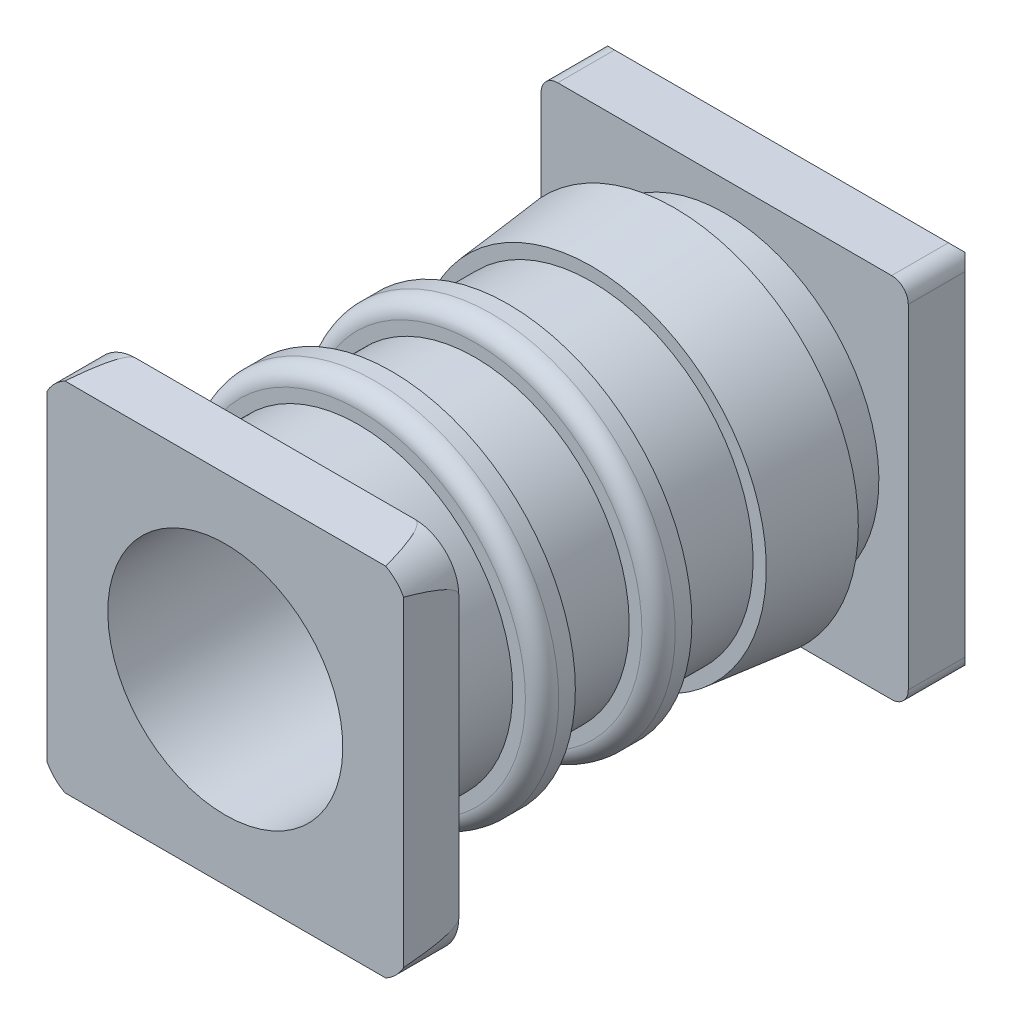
ISO-10303-21;
HEADER;
FILE_DESCRIPTION(('STEP AP214'),'2;1');
FILE_NAME('part.step','',(''),(''),'','','');
FILE_SCHEMA(('AUTOMOTIVE_DESIGN { 1 0 10303 214 1 1 1 1 }'));
ENDSEC;
DATA;
#1=APPLICATION_CONTEXT('core data for automotive mechanical design processes');
#2=APPLICATION_PROTOCOL_DEFINITION('international standard','automotive_design',2000,#1);
#3=PRODUCT_CONTEXT('',#1,'mechanical');
#4=PRODUCT('Part','Part','',(#3));
#5=PRODUCT_RELATED_PRODUCT_CATEGORY('part','',(#4));
#6=PRODUCT_DEFINITION_FORMATION('','',#4);
#7=PRODUCT_DEFINITION_CONTEXT('part definition',#1,'design');
#8=PRODUCT_DEFINITION('design','',#6,#7);
#9=PRODUCT_DEFINITION_SHAPE('','',#8);
#10=(LENGTH_UNIT() NAMED_UNIT(*) SI_UNIT(.MILLI.,.METRE.));
#11=(NAMED_UNIT(*) PLANE_ANGLE_UNIT() SI_UNIT($,.RADIAN.));
#12=(NAMED_UNIT(*) SI_UNIT($,.STERADIAN.) SOLID_ANGLE_UNIT());
#13=UNCERTAINTY_MEASURE_WITH_UNIT(LENGTH_MEASURE(1.E-05),#10,'distance_accuracy_value','');
#14=(GEOMETRIC_REPRESENTATION_CONTEXT(3) GLOBAL_UNCERTAINTY_ASSIGNED_CONTEXT((#13)) GLOBAL_UNIT_ASSIGNED_CONTEXT((#10,
#11,#12)) REPRESENTATION_CONTEXT('',''));
#15=CARTESIAN_POINT('',(0.,0.,0.));
#16=DIRECTION('',(0.,0.,1.));
#17=DIRECTION('',(1.,0.,0.));
#18=AXIS2_PLACEMENT_3D('',#15,#16,#17);
#19=CARTESIAN_POINT('',(-12.5,-12.5,30.6));
#20=DIRECTION('',(0.,0.,-1.));
#21=DIRECTION('',(0.,1.,0.));
#22=AXIS2_PLACEMENT_3D('',#19,#20,#21);
#23=PLANE('',#22);
#24=CARTESIAN_POINT('',(0.,0.,30.6));
#25=DIRECTION('',(0.,0.,-1.));
#26=DIRECTION('',(0.,1.,0.));
#27=AXIS2_PLACEMENT_3D('',#24,#25,#26);
#28=CIRCLE('',#27,10.5);
#29=CARTESIAN_POINT('',(0.,10.5,30.6));
#30=VERTEX_POINT('',#29);
#31=EDGE_CURVE('E288',#30,#30,#28,.F.);
#32=ORIENTED_EDGE('',*,*,#31,.T.);
#33=EDGE_LOOP('',(#32));
#34=FACE_BOUND('',#33,.T.);
#35=CARTESIAN_POINT('',(-9.5,-9.5,30.6));
#36=DIRECTION('',(0.,0.,-1.));
#37=DIRECTION('',(0.,1.,0.));
#38=AXIS2_PLACEMENT_3D('',#35,#36,#37);
#39=CIRCLE('',#38,3.);
#40=CARTESIAN_POINT('',(-12.5,-9.5,30.6));
#41=VERTEX_POINT('',#40);
#42=CARTESIAN_POINT('',(-9.5,-12.5,30.6));
#43=VERTEX_POINT('',#42);
#44=EDGE_CURVE('E175',#41,#43,#39,.F.);
#45=ORIENTED_EDGE('',*,*,#44,.F.);
#46=DIRECTION('',(0.,-1.,0.));
#47=VECTOR('',#46,1.);
#48=CARTESIAN_POINT('',(-12.5,-12.5,30.6));
#49=LINE('',#48,#47);
#50=CARTESIAN_POINT('',(-12.5,9.5,30.6));
#51=VERTEX_POINT('',#50);
#52=EDGE_CURVE('E234',#51,#41,#49,.T.);
#53=ORIENTED_EDGE('',*,*,#52,.F.);
#54=CARTESIAN_POINT('',(-9.5,9.5,30.6));
#55=DIRECTION('',(0.,0.,-1.));
#56=DIRECTION('',(0.,1.,0.));
#57=AXIS2_PLACEMENT_3D('',#54,#55,#56);
#58=CIRCLE('',#57,3.);
#59=CARTESIAN_POINT('',(-9.5,12.5,30.6));
#60=VERTEX_POINT('',#59);
#61=EDGE_CURVE('E410',#60,#51,#58,.F.);
#62=ORIENTED_EDGE('',*,*,#61,.F.);
#63=DIRECTION('',(1.,0.,0.));
#64=VECTOR('',#63,1.);
#65=CARTESIAN_POINT('',(12.5,12.5,30.6));
#66=LINE('',#65,#64);
#67=CARTESIAN_POINT('',(9.5,12.5,30.6));
#68=VERTEX_POINT('',#67);
#69=EDGE_CURVE('E237',#60,#68,#66,.T.);
#70=ORIENTED_EDGE('',*,*,#69,.T.);
#71=CARTESIAN_POINT('',(9.5,9.5,30.6));
#72=DIRECTION('',(0.,0.,-1.));
#73=DIRECTION('',(0.,1.,0.));
#74=AXIS2_PLACEMENT_3D('',#71,#72,#73);
#75=CIRCLE('',#74,3.);
#76=CARTESIAN_POINT('',(12.5,9.5,30.6));
#77=VERTEX_POINT('',#76);
#78=EDGE_CURVE('E38',#77,#68,#75,.F.);
#79=ORIENTED_EDGE('',*,*,#78,.F.);
#80=DIRECTION('',(0.,-1.,0.));
#81=VECTOR('',#80,1.);
#82=CARTESIAN_POINT('',(12.5,-12.5,30.6));
#83=LINE('',#82,#81);
#84=CARTESIAN_POINT('',(12.5,-9.5,30.6));
#85=VERTEX_POINT('',#84);
#86=EDGE_CURVE('E240',#85,#77,#83,.F.);
#87=ORIENTED_EDGE('',*,*,#86,.F.);
#88=CARTESIAN_POINT('',(9.5,-9.5,30.6));
#89=DIRECTION('',(0.,0.,-1.));
#90=DIRECTION('',(0.,1.,0.));
#91=AXIS2_PLACEMENT_3D('',#88,#89,#90);
#92=CIRCLE('',#91,3.);
#93=CARTESIAN_POINT('',(9.5,-12.5,30.6));
#94=VERTEX_POINT('',#93);
#95=EDGE_CURVE('E30',#94,#85,#92,.F.);
#96=ORIENTED_EDGE('',*,*,#95,.F.);
#97=DIRECTION('',(1.,0.,0.));
#98=VECTOR('',#97,1.);
#99=CARTESIAN_POINT('',(12.5,-12.5,30.6));
#100=LINE('',#99,#98);
#101=EDGE_CURVE('E243',#94,#43,#100,.F.);
#102=ORIENTED_EDGE('',*,*,#101,.T.);
#103=EDGE_LOOP('',(#45,#53,#62,#70,#79,#87,#96,#102));
#104=FACE_BOUND('',#103,.T.);
#105=ADVANCED_FACE('F14',(#34,#104),#23,.T.);
#106=CARTESIAN_POINT('',(5.25,0.,34.));
#107=DIRECTION('',(0.,0.,1.));
#108=DIRECTION('',(0.,-1.,0.));
#109=AXIS2_PLACEMENT_3D('',#106,#107,#108);
#110=PLANE('',#109);
#111=CARTESIAN_POINT('',(0.,0.,34.));
#112=DIRECTION('',(0.,0.,1.));
#113=DIRECTION('',(0.,-1.,0.));
#114=AXIS2_PLACEMENT_3D('',#111,#112,#113);
#115=CIRCLE('',#114,8.);
#116=CARTESIAN_POINT('',(0.,-8.,34.));
#117=VERTEX_POINT('',#116);
#118=EDGE_CURVE('E396',#117,#117,#115,.T.);
#119=ORIENTED_EDGE('',*,*,#118,.F.);
#120=EDGE_LOOP('',(#119));
#121=FACE_BOUND('',#120,.T.);
#122=CARTESIAN_POINT('',(-9.5,-9.5,34.));
#123=DIRECTION('',(0.,0.,-1.));
#124=DIRECTION('',(0.,-1.,0.));
#125=AXIS2_PLACEMENT_3D('',#122,#123,#124);
#126=CIRCLE('',#125,3.);
#127=CARTESIAN_POINT('',(-10.9200085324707,-12.1426456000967,34.));
#128=VERTEX_POINT('',#127);
#129=CARTESIAN_POINT('',(-12.1426456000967,-10.9200085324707,34.));
#130=VERTEX_POINT('',#129);
#131=EDGE_CURVE('E172',#128,#130,#126,.T.);
#132=ORIENTED_EDGE('',*,*,#131,.F.);
#133=DIRECTION('',(1.,0.,0.));
#134=VECTOR('',#133,1.);
#135=CARTESIAN_POINT('',(5.25,-12.1426456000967,34.));
#136=LINE('',#135,#134);
#137=CARTESIAN_POINT('',(10.9200085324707,-12.1426456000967,34.));
#138=VERTEX_POINT('',#137);
#139=EDGE_CURVE('E186',#128,#138,#136,.T.);
#140=ORIENTED_EDGE('',*,*,#139,.T.);
#141=CARTESIAN_POINT('',(9.5,-9.5,34.));
#142=DIRECTION('',(0.,0.,-1.));
#143=DIRECTION('',(0.,-1.,0.));
#144=AXIS2_PLACEMENT_3D('',#141,#142,#143);
#145=CIRCLE('',#144,3.);
#146=CARTESIAN_POINT('',(12.1426456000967,-10.9200085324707,34.));
#147=VERTEX_POINT('',#146);
#148=EDGE_CURVE('E190',#147,#138,#145,.T.);
#149=ORIENTED_EDGE('',*,*,#148,.F.);
#150=DIRECTION('',(0.,-1.,0.));
#151=VECTOR('',#150,1.);
#152=CARTESIAN_POINT('',(12.1426456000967,0.,34.));
#153=LINE('',#152,#151);
#154=CARTESIAN_POINT('',(12.1426456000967,10.9200085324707,34.));
#155=VERTEX_POINT('',#154);
#156=EDGE_CURVE('E195',#147,#155,#153,.F.);
#157=ORIENTED_EDGE('',*,*,#156,.T.);
#158=CARTESIAN_POINT('',(9.5,9.5,34.));
#159=DIRECTION('',(0.,0.,-1.));
#160=DIRECTION('',(0.,-1.,0.));
#161=AXIS2_PLACEMENT_3D('',#158,#159,#160);
#162=CIRCLE('',#161,3.);
#163=CARTESIAN_POINT('',(10.9200085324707,12.1426456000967,34.));
#164=VERTEX_POINT('',#163);
#165=EDGE_CURVE('E422',#164,#155,#162,.T.);
#166=ORIENTED_EDGE('',*,*,#165,.F.);
#167=DIRECTION('',(1.,0.,0.));
#168=VECTOR('',#167,1.);
#169=CARTESIAN_POINT('',(5.25,12.1426456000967,34.));
#170=LINE('',#169,#168);
#171=CARTESIAN_POINT('',(-10.9200085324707,12.1426456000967,34.));
#172=VERTEX_POINT('',#171);
#173=EDGE_CURVE('E199',#164,#172,#170,.F.);
#174=ORIENTED_EDGE('',*,*,#173,.T.);
#175=CARTESIAN_POINT('',(-9.5,9.5,34.));
#176=DIRECTION('',(0.,0.,1.));
#177=DIRECTION('',(0.,-1.,0.));
#178=AXIS2_PLACEMENT_3D('',#175,#176,#177);
#179=CIRCLE('',#178,3.);
#180=CARTESIAN_POINT('',(-12.1426456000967,10.9200085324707,34.));
#181=VERTEX_POINT('',#180);
#182=EDGE_CURVE('E249',#181,#172,#179,.F.);
#183=ORIENTED_EDGE('',*,*,#182,.F.);
#184=DIRECTION('',(0.,-1.,0.));
#185=VECTOR('',#184,1.);
#186=CARTESIAN_POINT('',(-12.1426456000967,0.,34.));
#187=LINE('',#186,#185);
#188=EDGE_CURVE('E189',#181,#130,#187,.T.);
#189=ORIENTED_EDGE('',*,*,#188,.T.);
#190=EDGE_LOOP('',(#132,#140,#149,#157,#166,#174,#183,#189));
#191=FACE_BOUND('',#190,.T.);
#192=ADVANCED_FACE('F184',(#121,#191),#110,.T.);
#193=CARTESIAN_POINT('',(0.,0.,15.8666666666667));
#194=DIRECTION('',(0.,0.,1.));
#195=DIRECTION('',(0.,-1.,0.));
#196=AXIS2_PLACEMENT_3D('',#193,#194,#195);
#197=TOROIDAL_SURFACE('',#196,11.3666666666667,1.13333333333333);
#198=CARTESIAN_POINT('',(0.,0.,15.8666666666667));
#199=DIRECTION('',(0.,0.,-1.));
#200=DIRECTION('',(0.,1.,0.));
#201=AXIS2_PLACEMENT_3D('',#198,#199,#200);
#202=CIRCLE('',#201,12.5);
#203=CARTESIAN_POINT('',(0.,12.5,15.8666666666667));
#204=VERTEX_POINT('',#203);
#205=EDGE_CURVE('E395',#204,#204,#202,.T.);
#206=ORIENTED_EDGE('',*,*,#205,.F.);
#207=EDGE_LOOP('',(#206));
#208=FACE_BOUND('',#207,.T.);
#209=CARTESIAN_POINT('',(0.,0.,17.));
#210=DIRECTION('',(0.,0.,-1.));
#211=DIRECTION('',(0.,1.,0.));
#212=AXIS2_PLACEMENT_3D('',#209,#210,#211);
#213=CIRCLE('',#212,11.3666666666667);
#214=CARTESIAN_POINT('',(11.3666666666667,0.,17.));
#215=VERTEX_POINT('',#214);
#216=CARTESIAN_POINT('',(0.,11.3666666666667,17.));
#217=VERTEX_POINT('',#216);
#218=EDGE_CURVE('E529',#215,#217,#213,.F.);
#219=ORIENTED_EDGE('',*,*,#218,.F.);
#220=CARTESIAN_POINT('',(0.,0.,17.));
#221=DIRECTION('',(0.,0.,-1.));
#222=DIRECTION('',(1.,0.,0.));
#223=AXIS2_PLACEMENT_3D('',#220,#221,#222);
#224=CIRCLE('',#223,11.3666666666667);
#225=CARTESIAN_POINT('',(0.,-11.3666666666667,17.));
#226=VERTEX_POINT('',#225);
#227=EDGE_CURVE('E524',#226,#215,#224,.F.);
#228=ORIENTED_EDGE('',*,*,#227,.F.);
#229=CARTESIAN_POINT('',(0.,0.,17.));
#230=DIRECTION('',(0.,0.,-1.));
#231=DIRECTION('',(0.,-1.,0.));
#232=AXIS2_PLACEMENT_3D('',#229,#230,#231);
#233=CIRCLE('',#232,11.3666666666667);
#234=EDGE_CURVE('E383',#217,#226,#233,.F.);
#235=ORIENTED_EDGE('',*,*,#234,.F.);
#236=EDGE_LOOP('',(#219,#228,#235));
#237=FACE_BOUND('',#236,.T.);
#238=ADVANCED_FACE('F16',(#208,#237),#197,.T.);
#239=CARTESIAN_POINT('',(0.,0.,15.3));
#240=DIRECTION('',(0.,0.,-1.));
#241=DIRECTION('',(0.,1.,0.));
#242=AXIS2_PLACEMENT_3D('',#239,#240,#241);
#243=CYLINDRICAL_SURFACE('',#242,12.5);
#244=ORIENTED_EDGE('',*,*,#205,.T.);
#245=EDGE_LOOP('',(#244));
#246=FACE_BOUND('',#245,.T.);
#247=CARTESIAN_POINT('',(0.,0.,14.7333333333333));
#248=DIRECTION('',(0.,0.,-1.));
#249=DIRECTION('',(0.,1.,0.));
#250=AXIS2_PLACEMENT_3D('',#247,#248,#249);
#251=CIRCLE('',#250,12.5);
#252=CARTESIAN_POINT('',(0.,12.5,14.7333333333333));
#253=VERTEX_POINT('',#252);
#254=EDGE_CURVE('E522',#253,#253,#251,.T.);
#255=ORIENTED_EDGE('',*,*,#254,.F.);
#256=EDGE_LOOP('',(#255));
#257=FACE_BOUND('',#256,.T.);
#258=ADVANCED_FACE('F888',(#246,#257),#243,.T.);
#259=CARTESIAN_POINT('',(10.9333333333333,0.,17.));
#260=DIRECTION('',(0.,0.,1.));
#261=DIRECTION('',(0.,-1.,0.));
#262=AXIS2_PLACEMENT_3D('',#259,#260,#261);
#263=PLANE('',#262);
#264=ORIENTED_EDGE('',*,*,#234,.T.);
#265=ORIENTED_EDGE('',*,*,#227,.T.);
#266=ORIENTED_EDGE('',*,*,#218,.T.);
#267=EDGE_LOOP('',(#264,#265,#266));
#268=FACE_BOUND('',#267,.T.);
#269=CARTESIAN_POINT('',(0.,0.,17.));
#270=DIRECTION('',(0.,0.,-1.));
#271=DIRECTION('',(0.,1.,0.));
#272=AXIS2_PLACEMENT_3D('',#269,#270,#271);
#273=CIRCLE('',#272,10.5);
#274=CARTESIAN_POINT('',(0.,10.5,17.));
#275=VERTEX_POINT('',#274);
#276=EDGE_CURVE('E520',#275,#275,#273,.F.);
#277=ORIENTED_EDGE('',*,*,#276,.F.);
#278=EDGE_LOOP('',(#277));
#279=FACE_BOUND('',#278,.T.);
#280=ADVANCED_FACE('F878',(#268,#279),#263,.T.);
#281=CARTESIAN_POINT('',(11.75,0.,14.7333333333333));
#282=DIRECTION('',(0.,0.,-1.));
#283=DIRECTION('',(0.,1.,0.));
#284=AXIS2_PLACEMENT_3D('',#281,#282,#283);
#285=PLANE('',#284);
#286=CARTESIAN_POINT('',(0.,0.,14.7333333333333));
#287=DIRECTION('',(0.,0.,-1.));
#288=DIRECTION('',(0.,1.,0.));
#289=AXIS2_PLACEMENT_3D('',#286,#287,#288);
#290=CIRCLE('',#289,11.);
#291=CARTESIAN_POINT('',(0.,11.,14.7333333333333));
#292=VERTEX_POINT('',#291);
#293=EDGE_CURVE('E517',#292,#292,#290,.T.);
#294=ORIENTED_EDGE('',*,*,#293,.F.);
#295=EDGE_LOOP('',(#294));
#296=FACE_BOUND('',#295,.T.);
#297=ORIENTED_EDGE('',*,*,#254,.T.);
#298=EDGE_LOOP('',(#297));
#299=FACE_BOUND('',#298,.T.);
#300=ADVANCED_FACE('F868',(#296,#299),#285,.T.);
#301=CARTESIAN_POINT('',(0.,0.,19.8333333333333));
#302=DIRECTION('',(0.,0.,-1.));
#303=DIRECTION('',(0.,1.,0.));
#304=AXIS2_PLACEMENT_3D('',#301,#302,#303);
#305=CYLINDRICAL_SURFACE('',#304,10.5);
#306=CARTESIAN_POINT('',(0.,0.,22.6666666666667));
#307=DIRECTION('',(0.,0.,-1.));
#308=DIRECTION('',(0.,1.,0.));
#309=AXIS2_PLACEMENT_3D('',#306,#307,#308);
#310=CIRCLE('',#309,10.5);
#311=CARTESIAN_POINT('',(0.,10.5,22.6666666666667));
#312=VERTEX_POINT('',#311);
#313=EDGE_CURVE('E514',#312,#312,#310,.F.);
#314=ORIENTED_EDGE('',*,*,#313,.F.);
#315=EDGE_LOOP('',(#314));
#316=FACE_BOUND('',#315,.T.);
#317=ORIENTED_EDGE('',*,*,#276,.T.);
#318=EDGE_LOOP('',(#317));
#319=FACE_BOUND('',#318,.T.);
#320=ADVANCED_FACE('F858',(#316,#319),#305,.T.);
#321=CARTESIAN_POINT('',(0.,0.,11.9));
#322=DIRECTION('',(0.,0.,-1.));
#323=DIRECTION('',(0.,1.,0.));
#324=AXIS2_PLACEMENT_3D('',#321,#322,#323);
#325=CYLINDRICAL_SURFACE('',#324,11.);
#326=ORIENTED_EDGE('',*,*,#293,.T.);
#327=EDGE_LOOP('',(#326));
#328=FACE_BOUND('',#327,.T.);
#329=CARTESIAN_POINT('',(0.,0.,9.0666666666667));
#330=DIRECTION('',(0.,0.,-1.));
#331=DIRECTION('',(0.,1.,0.));
#332=AXIS2_PLACEMENT_3D('',#329,#330,#331);
#333=CIRCLE('',#332,11.);
#334=CARTESIAN_POINT('',(0.,11.,9.0666666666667));
#335=VERTEX_POINT('',#334);
#336=EDGE_CURVE('E511',#335,#335,#333,.T.);
#337=ORIENTED_EDGE('',*,*,#336,.F.);
#338=EDGE_LOOP('',(#337));
#339=FACE_BOUND('',#338,.T.);
#340=ADVANCED_FACE('F848',(#328,#339),#325,.T.);
#341=CARTESIAN_POINT('',(11.5,0.,22.6666666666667));
#342=DIRECTION('',(0.,0.,-1.));
#343=DIRECTION('',(0.,1.,0.));
#344=AXIS2_PLACEMENT_3D('',#341,#342,#343);
#345=PLANE('',#344);
#346=ORIENTED_EDGE('',*,*,#313,.T.);
#347=EDGE_LOOP('',(#346));
#348=FACE_BOUND('',#347,.T.);
#349=CARTESIAN_POINT('',(0.,0.,22.6666666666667));
#350=DIRECTION('',(0.,0.,-1.));
#351=DIRECTION('',(0.,1.,0.));
#352=AXIS2_PLACEMENT_3D('',#349,#350,#351);
#353=CIRCLE('',#352,12.5);
#354=CARTESIAN_POINT('',(0.,12.5,22.6666666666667));
#355=VERTEX_POINT('',#354);
#356=EDGE_CURVE('E508',#355,#355,#353,.F.);
#357=ORIENTED_EDGE('',*,*,#356,.F.);
#358=EDGE_LOOP('',(#357));
#359=FACE_BOUND('',#358,.T.);
#360=ADVANCED_FACE('F838',(#348,#359),#345,.T.);
#361=CARTESIAN_POINT('',(11.4522046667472,0.,9.0666666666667));
#362=DIRECTION('',(0.,0.,1.));
#363=DIRECTION('',(-1.,0.,0.));
#364=AXIS2_PLACEMENT_3D('',#361,#362,#363);
#365=PLANE('',#364);
#366=CARTESIAN_POINT('',(0.,0.,9.0666666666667));
#367=DIRECTION('',(0.,0.,-1.));
#368=DIRECTION('',(0.,1.,0.));
#369=AXIS2_PLACEMENT_3D('',#366,#367,#368);
#370=CIRCLE('',#369,11.9044093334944);
#371=CARTESIAN_POINT('',(0.,11.9044093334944,9.0666666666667));
#372=VERTEX_POINT('',#371);
#373=EDGE_CURVE('E505',#372,#372,#370,.T.);
#374=ORIENTED_EDGE('',*,*,#373,.F.);
#375=EDGE_LOOP('',(#374));
#376=FACE_BOUND('',#375,.T.);
#377=ORIENTED_EDGE('',*,*,#336,.T.);
#378=EDGE_LOOP('',(#377));
#379=FACE_BOUND('',#378,.T.);
#380=ADVANCED_FACE('F829',(#376,#379),#365,.T.);
#381=CARTESIAN_POINT('',(0.,0.,23.2333333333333));
#382=DIRECTION('',(0.,0.,-1.));
#383=DIRECTION('',(0.,1.,0.));
#384=AXIS2_PLACEMENT_3D('',#381,#382,#383);
#385=CYLINDRICAL_SURFACE('',#384,12.5);
#386=ORIENTED_EDGE('',*,*,#356,.T.);
#387=EDGE_LOOP('',(#386));
#388=FACE_BOUND('',#387,.T.);
#389=CARTESIAN_POINT('',(0.,0.,23.8));
#390=DIRECTION('',(0.,0.,1.));
#391=DIRECTION('',(0.,-1.,0.));
#392=AXIS2_PLACEMENT_3D('',#389,#390,#391);
#393=CIRCLE('',#392,12.5);
#394=CARTESIAN_POINT('',(0.,-12.5,23.8));
#395=VERTEX_POINT('',#394);
#396=EDGE_CURVE('E352',#395,#395,#393,.T.);
#397=ORIENTED_EDGE('',*,*,#396,.F.);
#398=EDGE_LOOP('',(#397));
#399=FACE_BOUND('',#398,.T.);
#400=ADVANCED_FACE('F820',(#388,#399),#385,.T.);
#401=CARTESIAN_POINT('',(0.,0.,3.4));
#402=DIRECTION('',(0.,0.,-1.));
#403=DIRECTION('',(0.,1.,0.));
#404=AXIS2_PLACEMENT_3D('',#401,#402,#403);
#405=CONICAL_SURFACE('',#404,12.5,0.10471975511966);
#406=ORIENTED_EDGE('',*,*,#373,.T.);
#407=EDGE_LOOP('',(#406));
#408=FACE_BOUND('',#407,.T.);
#409=CARTESIAN_POINT('',(0.,0.,3.4));
#410=DIRECTION('',(0.,0.,-1.));
#411=DIRECTION('',(0.,1.,0.));
#412=AXIS2_PLACEMENT_3D('',#409,#410,#411);
#413=CIRCLE('',#412,12.5);
#414=CARTESIAN_POINT('',(0.,12.5,3.4));
#415=VERTEX_POINT('',#414);
#416=EDGE_CURVE('E344',#415,#415,#413,.T.);
#417=ORIENTED_EDGE('',*,*,#416,.F.);
#418=EDGE_LOOP('',(#417));
#419=FACE_BOUND('',#418,.T.);
#420=ADVANCED_FACE('F362',(#408,#419),#405,.T.);
#421=CARTESIAN_POINT('',(0.,0.,23.8));
#422=DIRECTION('',(0.,0.,1.));
#423=DIRECTION('',(0.,-1.,0.));
#424=AXIS2_PLACEMENT_3D('',#421,#422,#423);
#425=TOROIDAL_SURFACE('',#424,11.3666666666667,1.13333333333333);
#426=ORIENTED_EDGE('',*,*,#396,.T.);
#427=EDGE_LOOP('',(#426));
#428=FACE_BOUND('',#427,.T.);
#429=CARTESIAN_POINT('',(0.,0.,24.9333333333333));
#430=DIRECTION('',(0.,0.,-1.));
#431=DIRECTION('',(0.,1.,0.));
#432=AXIS2_PLACEMENT_3D('',#429,#430,#431);
#433=CIRCLE('',#432,11.3666666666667);
#434=CARTESIAN_POINT('',(11.3666666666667,0.,24.9333333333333));
#435=VERTEX_POINT('',#434);
#436=CARTESIAN_POINT('',(0.,11.3666666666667,24.9333333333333));
#437=VERTEX_POINT('',#436);
#438=EDGE_CURVE('E299',#435,#437,#433,.F.);
#439=ORIENTED_EDGE('',*,*,#438,.F.);
#440=CARTESIAN_POINT('',(0.,0.,24.9333333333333));
#441=DIRECTION('',(0.,0.,-1.));
#442=DIRECTION('',(1.,0.,0.));
#443=AXIS2_PLACEMENT_3D('',#440,#441,#442);
#444=CIRCLE('',#443,11.3666666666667);
#445=CARTESIAN_POINT('',(0.,-11.3666666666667,24.9333333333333));
#446=VERTEX_POINT('',#445);
#447=EDGE_CURVE('E335',#446,#435,#444,.F.);
#448=ORIENTED_EDGE('',*,*,#447,.F.);
#449=CARTESIAN_POINT('',(0.,0.,24.9333333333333));
#450=DIRECTION('',(0.,0.,-1.));
#451=DIRECTION('',(0.,-1.,0.));
#452=AXIS2_PLACEMENT_3D('',#449,#450,#451);
#453=CIRCLE('',#452,11.3666666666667);
#454=EDGE_CURVE('E337',#437,#446,#453,.F.);
#455=ORIENTED_EDGE('',*,*,#454,.F.);
#456=EDGE_LOOP('',(#439,#448,#455));
#457=FACE_BOUND('',#456,.T.);
#458=ADVANCED_FACE('F342',(#428,#457),#425,.T.);
#459=CARTESIAN_POINT('',(11.5,0.,3.4));
#460=DIRECTION('',(0.,0.,-1.));
#461=DIRECTION('',(1.,0.,0.));
#462=AXIS2_PLACEMENT_3D('',#459,#460,#461);
#463=PLANE('',#462);
#464=CARTESIAN_POINT('',(0.,0.,3.4));
#465=DIRECTION('',(0.,0.,-1.));
#466=DIRECTION('',(0.,1.,0.));
#467=AXIS2_PLACEMENT_3D('',#464,#465,#466);
#468=CIRCLE('',#467,10.5);
#469=CARTESIAN_POINT('',(0.,10.5,3.4));
#470=VERTEX_POINT('',#469);
#471=EDGE_CURVE('E340',#470,#470,#468,.T.);
#472=ORIENTED_EDGE('',*,*,#471,.F.);
#473=EDGE_LOOP('',(#472));
#474=FACE_BOUND('',#473,.T.);
#475=ORIENTED_EDGE('',*,*,#416,.T.);
#476=EDGE_LOOP('',(#475));
#477=FACE_BOUND('',#476,.T.);
#478=ADVANCED_FACE('F317',(#474,#477),#463,.T.);
#479=CARTESIAN_POINT('',(10.9333333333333,0.,24.9333333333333));
#480=DIRECTION('',(0.,0.,1.));
#481=DIRECTION('',(0.,-1.,0.));
#482=AXIS2_PLACEMENT_3D('',#479,#480,#481);
#483=PLANE('',#482);
#484=ORIENTED_EDGE('',*,*,#454,.T.);
#485=ORIENTED_EDGE('',*,*,#447,.T.);
#486=ORIENTED_EDGE('',*,*,#438,.T.);
#487=EDGE_LOOP('',(#484,#485,#486));
#488=FACE_BOUND('',#487,.T.);
#489=CARTESIAN_POINT('',(0.,0.,24.9333333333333));
#490=DIRECTION('',(0.,0.,-1.));
#491=DIRECTION('',(0.,1.,0.));
#492=AXIS2_PLACEMENT_3D('',#489,#490,#491);
#493=CIRCLE('',#492,10.5);
#494=CARTESIAN_POINT('',(0.,10.5,24.9333333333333));
#495=VERTEX_POINT('',#494);
#496=EDGE_CURVE('E494',#495,#495,#493,.F.);
#497=ORIENTED_EDGE('',*,*,#496,.F.);
#498=EDGE_LOOP('',(#497));
#499=FACE_BOUND('',#498,.T.);
#500=ADVANCED_FACE('F306',(#488,#499),#483,.T.);
#501=CARTESIAN_POINT('',(0.,0.,-0.8));
#502=DIRECTION('',(0.,0.,-1.));
#503=DIRECTION('',(0.,1.,0.));
#504=AXIS2_PLACEMENT_3D('',#501,#502,#503);
#505=CYLINDRICAL_SURFACE('',#504,10.5);
#506=CARTESIAN_POINT('',(0.,0.,0.));
#507=DIRECTION('',(0.,0.,-1.));
#508=DIRECTION('',(0.,1.,0.));
#509=AXIS2_PLACEMENT_3D('',#506,#507,#508);
#510=CIRCLE('',#509,10.5);
#511=CARTESIAN_POINT('',(0.,10.5,0.));
#512=VERTEX_POINT('',#511);
#513=EDGE_CURVE('E547',#512,#512,#510,.T.);
#514=ORIENTED_EDGE('',*,*,#513,.F.);
#515=EDGE_LOOP('',(#514));
#516=FACE_BOUND('',#515,.T.);
#517=ORIENTED_EDGE('',*,*,#471,.T.);
#518=EDGE_LOOP('',(#517));
#519=FACE_BOUND('',#518,.T.);
#520=ADVANCED_FACE('F316',(#516,#519),#505,.T.);
#521=CARTESIAN_POINT('',(0.,0.,29.4666666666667));
#522=DIRECTION('',(0.,0.,-1.));
#523=DIRECTION('',(0.,1.,0.));
#524=AXIS2_PLACEMENT_3D('',#521,#522,#523);
#525=CYLINDRICAL_SURFACE('',#524,10.5);
#526=ORIENTED_EDGE('',*,*,#31,.F.);
#527=EDGE_LOOP('',(#526));
#528=FACE_BOUND('',#527,.T.);
#529=ORIENTED_EDGE('',*,*,#496,.T.);
#530=EDGE_LOOP('',(#529));
#531=FACE_BOUND('',#530,.T.);
#532=ADVANCED_FACE('F481',(#528,#531),#525,.T.);
#533=CARTESIAN_POINT('',(-11.3666666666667,-11.3666666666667,-5.));
#534=DIRECTION('',(0.,0.,-1.));
#535=DIRECTION('',(0.,1.,0.));
#536=AXIS2_PLACEMENT_3D('',#533,#534,#535);
#537=CYLINDRICAL_SURFACE('',#536,1.13333333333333);
#538=DIRECTION('',(0.,0.,1.));
#539=VECTOR('',#538,1.);
#540=CARTESIAN_POINT('',(-12.5,-11.3666666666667,-5.));
#541=LINE('',#540,#539);
#542=CARTESIAN_POINT('',(-12.5,-11.3666666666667,-3.86666666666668));
#543=VERTEX_POINT('',#542);
#544=CARTESIAN_POINT('',(-12.5,-11.3666666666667,0.));
#545=VERTEX_POINT('',#544);
#546=EDGE_CURVE('E279',#543,#545,#541,.T.);
#547=ORIENTED_EDGE('',*,*,#546,.F.);
#548=CARTESIAN_POINT('',(-11.3666666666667,-11.3666666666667,-5.));
#549=DIRECTION('',(0.707106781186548,0.,0.707106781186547));
#550=DIRECTION('',(0.707106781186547,0.,-0.707106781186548));
#551=AXIS2_PLACEMENT_3D('',#548,#549,#550);
#552=ELLIPSE('',#551,1.6027753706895,1.13333333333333);
#553=CARTESIAN_POINT('',(-12.1680543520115,-12.1680543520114,-4.19861231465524));
#554=VERTEX_POINT('',#553);
#555=EDGE_CURVE('E497',#543,#554,#552,.T.);
#556=ORIENTED_EDGE('',*,*,#555,.T.);
#557=CARTESIAN_POINT('',(-11.3666666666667,-11.3666666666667,-5.));
#558=DIRECTION('',(0.,0.707106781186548,0.707106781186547));
#559=DIRECTION('',(0.,0.707106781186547,-0.707106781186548));
#560=AXIS2_PLACEMENT_3D('',#557,#558,#559);
#561=ELLIPSE('',#560,1.6027753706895,1.13333333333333);
#562=CARTESIAN_POINT('',(-11.3666666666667,-12.5,-3.86666666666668));
#563=VERTEX_POINT('',#562);
#564=EDGE_CURVE('E495',#554,#563,#561,.T.);
#565=ORIENTED_EDGE('',*,*,#564,.T.);
#566=DIRECTION('',(0.,0.,1.));
#567=VECTOR('',#566,1.);
#568=CARTESIAN_POINT('',(-11.3666666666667,-12.5,-5.));
#569=LINE('',#568,#567);
#570=CARTESIAN_POINT('',(-11.3666666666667,-12.5,0.));
#571=VERTEX_POINT('',#570);
#572=EDGE_CURVE('E281',#571,#563,#569,.F.);
#573=ORIENTED_EDGE('',*,*,#572,.F.);
#574=CARTESIAN_POINT('',(-11.3666666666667,-11.3666666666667,0.));
#575=DIRECTION('',(0.,0.,-1.));
#576=DIRECTION('',(0.,1.,0.));
#577=AXIS2_PLACEMENT_3D('',#574,#575,#576);
#578=CIRCLE('',#577,1.13333333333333);
#579=EDGE_CURVE('E552',#545,#571,#578,.F.);
#580=ORIENTED_EDGE('',*,*,#579,.F.);
#581=EDGE_LOOP('',(#547,#556,#565,#573,#580));
#582=FACE_BOUND('',#581,.T.);
#583=ADVANCED_FACE('F478',(#582),#537,.T.);
#584=CARTESIAN_POINT('',(-11.3666666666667,11.3666666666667,-5.));
#585=DIRECTION('',(0.,0.,-1.));
#586=DIRECTION('',(0.,1.,0.));
#587=AXIS2_PLACEMENT_3D('',#584,#585,#586);
#588=CYLINDRICAL_SURFACE('',#587,1.13333333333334);
#589=CARTESIAN_POINT('',(-11.3666666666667,11.3666666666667,0.));
#590=DIRECTION('',(0.,0.,-1.));
#591=DIRECTION('',(0.,1.,0.));
#592=AXIS2_PLACEMENT_3D('',#589,#590,#591);
#593=CIRCLE('',#592,1.13333333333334);
#594=CARTESIAN_POINT('',(-11.3666666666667,12.5,0.));
#595=VERTEX_POINT('',#594);
#596=CARTESIAN_POINT('',(-12.5,11.3666666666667,0.));
#597=VERTEX_POINT('',#596);
#598=EDGE_CURVE('E554',#595,#597,#593,.F.);
#599=ORIENTED_EDGE('',*,*,#598,.F.);
#600=DIRECTION('',(0.,0.,1.));
#601=VECTOR('',#600,1.);
#602=CARTESIAN_POINT('',(-11.3666666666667,12.5,-5.));
#603=LINE('',#602,#601);
#604=CARTESIAN_POINT('',(-11.3666666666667,12.5,-3.86666666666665));
#605=VERTEX_POINT('',#604);
#606=EDGE_CURVE('E273',#605,#595,#603,.T.);
#607=ORIENTED_EDGE('',*,*,#606,.F.);
#608=CARTESIAN_POINT('',(-11.3666666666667,11.3666666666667,-5.));
#609=DIRECTION('',(0.,-0.707106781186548,0.707106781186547));
#610=DIRECTION('',(0.,-0.707106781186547,-0.707106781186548));
#611=AXIS2_PLACEMENT_3D('',#608,#609,#610);
#612=ELLIPSE('',#611,1.60277537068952,1.13333333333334);
#613=CARTESIAN_POINT('',(-12.1680543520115,12.1680543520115,-4.19861231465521));
#614=VERTEX_POINT('',#613);
#615=EDGE_CURVE('E562',#605,#614,#612,.T.);
#616=ORIENTED_EDGE('',*,*,#615,.T.);
#617=CARTESIAN_POINT('',(-11.3666666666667,11.3666666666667,-5.));
#618=DIRECTION('',(0.707106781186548,0.,0.707106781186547));
#619=DIRECTION('',(0.707106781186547,0.,-0.707106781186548));
#620=AXIS2_PLACEMENT_3D('',#617,#618,#619);
#621=ELLIPSE('',#620,1.60277537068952,1.13333333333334);
#622=CARTESIAN_POINT('',(-12.5,11.3666666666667,-3.86666666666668));
#623=VERTEX_POINT('',#622);
#624=EDGE_CURVE('E560',#614,#623,#621,.T.);
#625=ORIENTED_EDGE('',*,*,#624,.T.);
#626=DIRECTION('',(0.,0.,1.));
#627=VECTOR('',#626,1.);
#628=CARTESIAN_POINT('',(-12.5,11.3666666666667,-5.));
#629=LINE('',#628,#627);
#630=EDGE_CURVE('E275',#597,#623,#629,.F.);
#631=ORIENTED_EDGE('',*,*,#630,.F.);
#632=EDGE_LOOP('',(#599,#607,#616,#625,#631));
#633=FACE_BOUND('',#632,.T.);
#634=ADVANCED_FACE('F474',(#633),#588,.T.);
#635=CARTESIAN_POINT('',(11.3666666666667,11.3666666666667,-5.));
#636=DIRECTION('',(0.,0.,-1.));
#637=DIRECTION('',(0.,1.,0.));
#638=AXIS2_PLACEMENT_3D('',#635,#636,#637);
#639=CYLINDRICAL_SURFACE('',#638,1.13333333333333);
#640=DIRECTION('',(0.,0.,1.));
#641=VECTOR('',#640,1.);
#642=CARTESIAN_POINT('',(12.5,11.3666666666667,-5.));
#643=LINE('',#642,#641);
#644=CARTESIAN_POINT('',(12.5,11.3666666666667,-3.86666666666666));
#645=VERTEX_POINT('',#644);
#646=CARTESIAN_POINT('',(12.5,11.3666666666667,0.));
#647=VERTEX_POINT('',#646);
#648=EDGE_CURVE('E264',#645,#647,#643,.T.);
#649=ORIENTED_EDGE('',*,*,#648,.F.);
#650=CARTESIAN_POINT('',(11.3666666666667,11.3666666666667,-5.));
#651=DIRECTION('',(-0.707106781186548,0.,0.707106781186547));
#652=DIRECTION('',(-0.707106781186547,0.,-0.707106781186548));
#653=AXIS2_PLACEMENT_3D('',#650,#651,#652);
#654=ELLIPSE('',#653,1.6027753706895,1.13333333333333);
#655=CARTESIAN_POINT('',(12.1680543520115,12.1680543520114,-4.19861231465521));
#656=VERTEX_POINT('',#655);
#657=EDGE_CURVE('E556',#645,#656,#654,.T.);
#658=ORIENTED_EDGE('',*,*,#657,.T.);
#659=CARTESIAN_POINT('',(11.3666666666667,11.3666666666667,-5.));
#660=DIRECTION('',(0.,-0.707106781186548,0.707106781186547));
#661=DIRECTION('',(0.,-0.707106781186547,-0.707106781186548));
#662=AXIS2_PLACEMENT_3D('',#659,#660,#661);
#663=ELLIPSE('',#662,1.6027753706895,1.13333333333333);
#664=CARTESIAN_POINT('',(11.3666666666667,12.5,-3.86666666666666));
#665=VERTEX_POINT('',#664);
#666=EDGE_CURVE('E558',#656,#665,#663,.T.);
#667=ORIENTED_EDGE('',*,*,#666,.T.);
#668=DIRECTION('',(0.,0.,1.));
#669=VECTOR('',#668,1.);
#670=CARTESIAN_POINT('',(11.3666666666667,12.5,-5.));
#671=LINE('',#670,#669);
#672=CARTESIAN_POINT('',(11.3666666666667,12.5,0.));
#673=VERTEX_POINT('',#672);
#674=EDGE_CURVE('E266',#673,#665,#671,.F.);
#675=ORIENTED_EDGE('',*,*,#674,.F.);
#676=CARTESIAN_POINT('',(11.3666666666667,11.3666666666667,0.));
#677=DIRECTION('',(0.,0.,-1.));
#678=DIRECTION('',(0.,1.,0.));
#679=AXIS2_PLACEMENT_3D('',#676,#677,#678);
#680=CIRCLE('',#679,1.13333333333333);
#681=EDGE_CURVE('E550',#647,#673,#680,.F.);
#682=ORIENTED_EDGE('',*,*,#681,.F.);
#683=EDGE_LOOP('',(#649,#658,#667,#675,#682));
#684=FACE_BOUND('',#683,.T.);
#685=ADVANCED_FACE('F470',(#684),#639,.T.);
#686=CARTESIAN_POINT('',(0.,0.,0.));
#687=DIRECTION('',(0.,0.,1.));
#688=DIRECTION('',(0.,-1.,0.));
#689=AXIS2_PLACEMENT_3D('',#686,#687,#688);
#690=PLANE('',#689);
#691=ORIENTED_EDGE('',*,*,#513,.T.);
#692=EDGE_LOOP('',(#691));
#693=FACE_BOUND('',#692,.T.);
#694=ORIENTED_EDGE('',*,*,#681,.T.);
#695=DIRECTION('',(-1.,0.,0.));
#696=VECTOR('',#695,1.);
#697=CARTESIAN_POINT('',(-11.3666666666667,12.5,0.));
#698=LINE('',#697,#696);
#699=EDGE_CURVE('E272',#595,#673,#698,.F.);
#700=ORIENTED_EDGE('',*,*,#699,.F.);
#701=ORIENTED_EDGE('',*,*,#598,.T.);
#702=DIRECTION('',(0.,-1.,0.));
#703=VECTOR('',#702,1.);
#704=CARTESIAN_POINT('',(-12.5,-11.3666666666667,0.));
#705=LINE('',#704,#703);
#706=EDGE_CURVE('E278',#545,#597,#705,.F.);
#707=ORIENTED_EDGE('',*,*,#706,.F.);
#708=ORIENTED_EDGE('',*,*,#579,.T.);
#709=DIRECTION('',(1.,0.,0.));
#710=VECTOR('',#709,1.);
#711=CARTESIAN_POINT('',(11.3666666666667,-12.5,0.));
#712=LINE('',#711,#710);
#713=CARTESIAN_POINT('',(11.3666666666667,-12.5,0.));
#714=VERTEX_POINT('',#713);
#715=EDGE_CURVE('E284',#714,#571,#712,.F.);
#716=ORIENTED_EDGE('',*,*,#715,.F.);
#717=CARTESIAN_POINT('',(11.3666666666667,-11.3666666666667,0.));
#718=DIRECTION('',(0.,0.,-1.));
#719=DIRECTION('',(0.,1.,0.));
#720=AXIS2_PLACEMENT_3D('',#717,#718,#719);
#721=CIRCLE('',#720,1.13333333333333);
#722=CARTESIAN_POINT('',(12.5,-11.3666666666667,0.));
#723=VERTEX_POINT('',#722);
#724=EDGE_CURVE('E541',#723,#714,#721,.T.);
#725=ORIENTED_EDGE('',*,*,#724,.F.);
#726=DIRECTION('',(0.,1.,0.));
#727=VECTOR('',#726,1.);
#728=CARTESIAN_POINT('',(12.5,11.3666666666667,0.));
#729=LINE('',#728,#727);
#730=EDGE_CURVE('E263',#647,#723,#729,.F.);
#731=ORIENTED_EDGE('',*,*,#730,.F.);
#732=EDGE_LOOP('',(#694,#700,#701,#707,#708,#716,#725,#731));
#733=FACE_BOUND('',#732,.T.);
#734=ADVANCED_FACE('F466',(#693,#733),#690,.T.);
#735=CARTESIAN_POINT('',(11.3666666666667,-11.3666666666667,-5.));
#736=DIRECTION('',(0.,0.,-1.));
#737=DIRECTION('',(0.,1.,0.));
#738=AXIS2_PLACEMENT_3D('',#735,#736,#737);
#739=CYLINDRICAL_SURFACE('',#738,1.13333333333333);
#740=ORIENTED_EDGE('',*,*,#724,.T.);
#741=DIRECTION('',(0.,0.,1.));
#742=VECTOR('',#741,1.);
#743=CARTESIAN_POINT('',(11.3666666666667,-12.5,-5.));
#744=LINE('',#743,#742);
#745=CARTESIAN_POINT('',(11.3666666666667,-12.5,-3.86666666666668));
#746=VERTEX_POINT('',#745);
#747=EDGE_CURVE('E285',#746,#714,#744,.T.);
#748=ORIENTED_EDGE('',*,*,#747,.F.);
#749=CARTESIAN_POINT('',(11.3666666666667,-11.3666666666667,-5.));
#750=DIRECTION('',(0.,0.707106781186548,0.707106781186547));
#751=DIRECTION('',(0.,0.707106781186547,-0.707106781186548));
#752=AXIS2_PLACEMENT_3D('',#749,#750,#751);
#753=ELLIPSE('',#752,1.6027753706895,1.13333333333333);
#754=CARTESIAN_POINT('',(12.1680543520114,-12.1680543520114,-4.19861231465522));
#755=VERTEX_POINT('',#754);
#756=EDGE_CURVE('E545',#746,#755,#753,.T.);
#757=ORIENTED_EDGE('',*,*,#756,.T.);
#758=CARTESIAN_POINT('',(11.3666666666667,-11.3666666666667,-5.));
#759=DIRECTION('',(-0.707106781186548,0.,0.707106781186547));
#760=DIRECTION('',(-0.707106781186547,0.,-0.707106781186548));
#761=AXIS2_PLACEMENT_3D('',#758,#759,#760);
#762=ELLIPSE('',#761,1.6027753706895,1.13333333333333);
#763=CARTESIAN_POINT('',(12.5,-11.3666666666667,-3.86666666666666));
#764=VERTEX_POINT('',#763);
#765=EDGE_CURVE('E543',#755,#764,#762,.T.);
#766=ORIENTED_EDGE('',*,*,#765,.T.);
#767=DIRECTION('',(0.,0.,1.));
#768=VECTOR('',#767,1.);
#769=CARTESIAN_POINT('',(12.5,-11.3666666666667,-5.));
#770=LINE('',#769,#768);
#771=EDGE_CURVE('E245',#723,#764,#770,.F.);
#772=ORIENTED_EDGE('',*,*,#771,.F.);
#773=EDGE_LOOP('',(#740,#748,#757,#766,#772));
#774=FACE_BOUND('',#773,.T.);
#775=ADVANCED_FACE('F463',(#774),#739,.T.);
#776=CARTESIAN_POINT('',(11.3666666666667,-12.5,-5.));
#777=DIRECTION('',(0.,-1.,0.));
#778=DIRECTION('',(1.,0.,0.));
#779=AXIS2_PLACEMENT_3D('',#776,#777,#778);
#780=PLANE('',#779);
#781=ORIENTED_EDGE('',*,*,#715,.T.);
#782=ORIENTED_EDGE('',*,*,#572,.T.);
#783=DIRECTION('',(1.,0.,0.));
#784=VECTOR('',#783,1.);
#785=CARTESIAN_POINT('',(25.,-12.5,-3.86666666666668));
#786=LINE('',#785,#784);
#787=EDGE_CURVE('E231',#563,#746,#786,.T.);
#788=ORIENTED_EDGE('',*,*,#787,.T.);
#789=ORIENTED_EDGE('',*,*,#747,.T.);
#790=EDGE_LOOP('',(#781,#782,#788,#789));
#791=FACE_BOUND('',#790,.T.);
#792=ADVANCED_FACE('F461',(#791),#780,.T.);
#793=CARTESIAN_POINT('',(-12.5,-11.3666666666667,-5.));
#794=DIRECTION('',(-1.,0.,0.));
#795=DIRECTION('',(0.,-1.,0.));
#796=AXIS2_PLACEMENT_3D('',#793,#794,#795);
#797=PLANE('',#796);
#798=ORIENTED_EDGE('',*,*,#706,.T.);
#799=ORIENTED_EDGE('',*,*,#630,.T.);
#800=DIRECTION('',(0.,-1.,0.));
#801=VECTOR('',#800,1.);
#802=CARTESIAN_POINT('',(-12.5,-25.,-3.86666666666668));
#803=LINE('',#802,#801);
#804=EDGE_CURVE('E226',#623,#543,#803,.T.);
#805=ORIENTED_EDGE('',*,*,#804,.T.);
#806=ORIENTED_EDGE('',*,*,#546,.T.);
#807=EDGE_LOOP('',(#798,#799,#805,#806));
#808=FACE_BOUND('',#807,.T.);
#809=ADVANCED_FACE('F585',(#808),#797,.T.);
#810=CARTESIAN_POINT('',(-11.3666666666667,12.5,-5.));
#811=DIRECTION('',(0.,1.,0.));
#812=DIRECTION('',(-1.,0.,0.));
#813=AXIS2_PLACEMENT_3D('',#810,#811,#812);
#814=PLANE('',#813);
#815=ORIENTED_EDGE('',*,*,#699,.T.);
#816=ORIENTED_EDGE('',*,*,#674,.T.);
#817=DIRECTION('',(1.,0.,0.));
#818=VECTOR('',#817,1.);
#819=CARTESIAN_POINT('',(25.,12.5,-3.86666666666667));
#820=LINE('',#819,#818);
#821=EDGE_CURVE('E218',#665,#605,#820,.F.);
#822=ORIENTED_EDGE('',*,*,#821,.T.);
#823=ORIENTED_EDGE('',*,*,#606,.T.);
#824=EDGE_LOOP('',(#815,#816,#822,#823));
#825=FACE_BOUND('',#824,.T.);
#826=ADVANCED_FACE('F609',(#825),#814,.T.);
#827=CARTESIAN_POINT('',(12.5,11.3666666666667,-5.));
#828=DIRECTION('',(1.,0.,0.));
#829=DIRECTION('',(0.,1.,0.));
#830=AXIS2_PLACEMENT_3D('',#827,#828,#829);
#831=PLANE('',#830);
#832=ORIENTED_EDGE('',*,*,#730,.T.);
#833=ORIENTED_EDGE('',*,*,#771,.T.);
#834=DIRECTION('',(0.,-1.,0.));
#835=VECTOR('',#834,1.);
#836=CARTESIAN_POINT('',(12.5,-25.,-3.86666666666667));
#837=LINE('',#836,#835);
#838=EDGE_CURVE('E210',#764,#645,#837,.F.);
#839=ORIENTED_EDGE('',*,*,#838,.T.);
#840=ORIENTED_EDGE('',*,*,#648,.T.);
#841=EDGE_LOOP('',(#832,#833,#839,#840));
#842=FACE_BOUND('',#841,.T.);
#843=ADVANCED_FACE('F602',(#842),#831,.T.);
#844=CARTESIAN_POINT('',(12.5,-12.5,30.6));
#845=DIRECTION('',(0.,0.994521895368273,-0.104528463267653));
#846=DIRECTION('',(0.,0.104528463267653,0.994521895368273));
#847=AXIS2_PLACEMENT_3D('',#844,#845,#846);
#848=PLANE('',#847);
#849=ORIENTED_EDGE('',*,*,#139,.F.);
#850=CARTESIAN_POINT('',(-9.5,-9.5,59.1430933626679));
#851=DIRECTION('',(0.,0.994521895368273,-0.104528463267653));
#852=DIRECTION('',(0.,0.104528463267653,0.994521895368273));
#853=AXIS2_PLACEMENT_3D('',#850,#851,#852);
#854=ELLIPSE('',#853,28.700316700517,3.);
#855=EDGE_CURVE('E169',#128,#43,#854,.F.);
#856=ORIENTED_EDGE('',*,*,#855,.T.);
#857=ORIENTED_EDGE('',*,*,#101,.F.);
#858=CARTESIAN_POINT('',(9.5,-9.5,59.1430933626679));
#859=DIRECTION('',(0.,0.994521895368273,-0.104528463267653));
#860=DIRECTION('',(0.,0.104528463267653,0.994521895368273));
#861=AXIS2_PLACEMENT_3D('',#858,#859,#860);
#862=ELLIPSE('',#861,28.700316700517,3.);
#863=EDGE_CURVE('E194',#94,#138,#862,.F.);
#864=ORIENTED_EDGE('',*,*,#863,.T.);
#865=EDGE_LOOP('',(#849,#856,#857,#864));
#866=FACE_BOUND('',#865,.T.);
#867=ADVANCED_FACE('F193',(#866),#848,.F.);
#868=CARTESIAN_POINT('',(12.5,-12.5,30.6));
#869=DIRECTION('',(0.994521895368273,0.,0.104528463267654));
#870=DIRECTION('',(-0.104528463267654,0.,0.994521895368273));
#871=AXIS2_PLACEMENT_3D('',#868,#869,#870);
#872=PLANE('',#871);
#873=CARTESIAN_POINT('',(9.5,-9.5,59.1430933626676));
#874=DIRECTION('',(0.994521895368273,0.,0.104528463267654));
#875=DIRECTION('',(-0.104528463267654,0.,0.994521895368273));
#876=AXIS2_PLACEMENT_3D('',#873,#874,#875);
#877=ELLIPSE('',#876,28.7003167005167,3.);
#878=EDGE_CURVE('E9',#85,#147,#877,.F.);
#879=ORIENTED_EDGE('',*,*,#878,.F.);
#880=ORIENTED_EDGE('',*,*,#86,.T.);
#881=CARTESIAN_POINT('',(9.5,9.5,59.1430933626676));
#882=DIRECTION('',(0.994521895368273,0.,0.104528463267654));
#883=DIRECTION('',(-0.104528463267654,0.,0.994521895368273));
#884=AXIS2_PLACEMENT_3D('',#881,#882,#883);
#885=ELLIPSE('',#884,28.7003167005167,3.);
#886=EDGE_CURVE('E431',#155,#77,#885,.F.);
#887=ORIENTED_EDGE('',*,*,#886,.F.);
#888=ORIENTED_EDGE('',*,*,#156,.F.);
#889=EDGE_LOOP('',(#879,#880,#887,#888));
#890=FACE_BOUND('',#889,.T.);
#891=ADVANCED_FACE('F437',(#890),#872,.T.);
#892=CARTESIAN_POINT('',(12.5,12.1426456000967,34.));
#893=DIRECTION('',(0.,-0.994521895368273,-0.104528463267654));
#894=DIRECTION('',(0.,0.104528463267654,-0.994521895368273));
#895=AXIS2_PLACEMENT_3D('',#892,#893,#894);
#896=PLANE('',#895);
#897=ORIENTED_EDGE('',*,*,#173,.F.);
#898=CARTESIAN_POINT('',(9.5,9.5,59.1430933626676));
#899=DIRECTION('',(0.,-0.994521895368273,-0.104528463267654));
#900=DIRECTION('',(0.,-0.104528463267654,0.994521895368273));
#901=AXIS2_PLACEMENT_3D('',#898,#899,#900);
#902=ELLIPSE('',#901,28.7003167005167,3.);
#903=EDGE_CURVE('E24',#164,#68,#902,.F.);
#904=ORIENTED_EDGE('',*,*,#903,.T.);
#905=ORIENTED_EDGE('',*,*,#69,.F.);
#906=CARTESIAN_POINT('',(-9.5,9.5,59.1430933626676));
#907=DIRECTION('',(0.,-0.994521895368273,-0.104528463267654));
#908=DIRECTION('',(0.,-0.104528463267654,0.994521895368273));
#909=AXIS2_PLACEMENT_3D('',#906,#907,#908);
#910=ELLIPSE('',#909,28.7003167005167,3.);
#911=EDGE_CURVE('E413',#60,#172,#910,.F.);
#912=ORIENTED_EDGE('',*,*,#911,.T.);
#913=EDGE_LOOP('',(#897,#904,#905,#912));
#914=FACE_BOUND('',#913,.T.);
#915=ADVANCED_FACE('F403',(#914),#896,.F.);
#916=CARTESIAN_POINT('',(-12.1426456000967,-12.5,34.));
#917=DIRECTION('',(-0.994521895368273,0.,0.104528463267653));
#918=DIRECTION('',(-0.104528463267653,0.,-0.994521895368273));
#919=AXIS2_PLACEMENT_3D('',#916,#917,#918);
#920=PLANE('',#919);
#921=CARTESIAN_POINT('',(-9.5,-9.5,59.1430933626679));
#922=DIRECTION('',(-0.994521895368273,0.,0.104528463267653));
#923=DIRECTION('',(0.104528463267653,0.,0.994521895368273));
#924=AXIS2_PLACEMENT_3D('',#921,#922,#923);
#925=ELLIPSE('',#924,28.700316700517,3.);
#926=EDGE_CURVE('E399',#130,#41,#925,.F.);
#927=ORIENTED_EDGE('',*,*,#926,.F.);
#928=ORIENTED_EDGE('',*,*,#188,.F.);
#929=CARTESIAN_POINT('',(-9.5,9.5,59.1430933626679));
#930=DIRECTION('',(-0.994521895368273,0.,0.104528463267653));
#931=DIRECTION('',(0.104528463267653,0.,0.994521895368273));
#932=AXIS2_PLACEMENT_3D('',#929,#930,#931);
#933=ELLIPSE('',#932,28.700316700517,3.);
#934=EDGE_CURVE('E414',#51,#181,#933,.F.);
#935=ORIENTED_EDGE('',*,*,#934,.F.);
#936=ORIENTED_EDGE('',*,*,#52,.T.);
#937=EDGE_LOOP('',(#927,#928,#935,#936));
#938=FACE_BOUND('',#937,.T.);
#939=ADVANCED_FACE('F425',(#938),#920,.T.);
#940=CARTESIAN_POINT('',(25.,-11.3666666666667,-5.));
#941=DIRECTION('',(0.,0.707106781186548,0.707106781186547));
#942=DIRECTION('',(0.,-0.707106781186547,0.707106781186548));
#943=AXIS2_PLACEMENT_3D('',#940,#941,#942);
#944=PLANE('',#943);
#945=ORIENTED_EDGE('',*,*,#787,.F.);
#946=ORIENTED_EDGE('',*,*,#564,.F.);
#947=DIRECTION('',(0.577350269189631,0.577350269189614,-0.577350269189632));
#948=VECTOR('',#947,1.);
#949=CARTESIAN_POINT('',(-12.1680543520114,-12.1680543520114,-4.19861231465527));
#950=LINE('',#949,#948);
#951=CARTESIAN_POINT('',(-11.3666666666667,-11.3666666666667,-5.));
#952=VERTEX_POINT('',#951);
#953=EDGE_CURVE('E223',#554,#952,#950,.T.);
#954=ORIENTED_EDGE('',*,*,#953,.T.);
#955=DIRECTION('',(1.,0.,0.));
#956=VECTOR('',#955,1.);
#957=CARTESIAN_POINT('',(5.25,-11.3666666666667,-5.));
#958=LINE('',#957,#956);
#959=CARTESIAN_POINT('',(11.3666666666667,-11.3666666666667,-5.));
#960=VERTEX_POINT('',#959);
#961=EDGE_CURVE('E253',#960,#952,#958,.F.);
#962=ORIENTED_EDGE('',*,*,#961,.F.);
#963=DIRECTION('',(0.577350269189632,-0.577350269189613,0.577350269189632));
#964=VECTOR('',#963,1.);
#965=CARTESIAN_POINT('',(11.3666666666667,-11.3666666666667,-5.));
#966=LINE('',#965,#964);
#967=EDGE_CURVE('E196',#960,#755,#966,.T.);
#968=ORIENTED_EDGE('',*,*,#967,.T.);
#969=ORIENTED_EDGE('',*,*,#756,.F.);
#970=EDGE_LOOP('',(#945,#946,#954,#962,#968,#969));
#971=FACE_BOUND('',#970,.T.);
#972=ADVANCED_FACE('F575',(#971),#944,.F.);
#973=CARTESIAN_POINT('',(-11.3666666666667,-25.,-5.));
#974=DIRECTION('',(0.707106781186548,0.,0.707106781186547));
#975=DIRECTION('',(-0.707106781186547,0.,0.707106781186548));
#976=AXIS2_PLACEMENT_3D('',#973,#974,#975);
#977=PLANE('',#976);
#978=ORIENTED_EDGE('',*,*,#555,.F.);
#979=ORIENTED_EDGE('',*,*,#804,.F.);
#980=ORIENTED_EDGE('',*,*,#624,.F.);
#981=DIRECTION('',(0.577350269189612,-0.577350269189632,-0.577350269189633));
#982=VECTOR('',#981,1.);
#983=CARTESIAN_POINT('',(-12.1680543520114,12.1680543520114,-4.19861231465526));
#984=LINE('',#983,#982);
#985=CARTESIAN_POINT('',(-11.3666666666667,11.3666666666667,-5.));
#986=VERTEX_POINT('',#985);
#987=EDGE_CURVE('E215',#614,#986,#984,.T.);
#988=ORIENTED_EDGE('',*,*,#987,.T.);
#989=DIRECTION('',(0.,1.,0.));
#990=VECTOR('',#989,1.);
#991=CARTESIAN_POINT('',(-11.3666666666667,0.,-5.));
#992=LINE('',#991,#990);
#993=EDGE_CURVE('E255',#952,#986,#992,.T.);
#994=ORIENTED_EDGE('',*,*,#993,.F.);
#995=ORIENTED_EDGE('',*,*,#953,.F.);
#996=EDGE_LOOP('',(#978,#979,#980,#988,#994,#995));
#997=FACE_BOUND('',#996,.T.);
#998=ADVANCED_FACE('F571',(#997),#977,.F.);
#999=CARTESIAN_POINT('',(25.,12.5,-3.86666666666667));
#1000=DIRECTION('',(0.,-0.707106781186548,0.707106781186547));
#1001=DIRECTION('',(0.,-0.707106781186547,-0.707106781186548));
#1002=AXIS2_PLACEMENT_3D('',#999,#1000,#1001);
#1003=PLANE('',#1002);
#1004=DIRECTION('',(-0.577350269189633,-0.577350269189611,-0.577350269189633));
#1005=VECTOR('',#1004,1.);
#1006=CARTESIAN_POINT('',(12.1680543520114,12.1680543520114,-4.19861231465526));
#1007=LINE('',#1006,#1005);
#1008=CARTESIAN_POINT('',(11.3666666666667,11.3666666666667,-5.));
#1009=VERTEX_POINT('',#1008);
#1010=EDGE_CURVE('E202',#656,#1009,#1007,.T.);
#1011=ORIENTED_EDGE('',*,*,#1010,.T.);
#1012=DIRECTION('',(1.,0.,0.));
#1013=VECTOR('',#1012,1.);
#1014=CARTESIAN_POINT('',(5.25,11.3666666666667,-5.));
#1015=LINE('',#1014,#1013);
#1016=EDGE_CURVE('E250',#986,#1009,#1015,.T.);
#1017=ORIENTED_EDGE('',*,*,#1016,.F.);
#1018=ORIENTED_EDGE('',*,*,#987,.F.);
#1019=ORIENTED_EDGE('',*,*,#615,.F.);
#1020=ORIENTED_EDGE('',*,*,#821,.F.);
#1021=ORIENTED_EDGE('',*,*,#666,.F.);
#1022=EDGE_LOOP('',(#1011,#1017,#1018,#1019,#1020,#1021));
#1023=FACE_BOUND('',#1022,.T.);
#1024=ADVANCED_FACE('F591',(#1023),#1003,.F.);
#1025=CARTESIAN_POINT('',(12.5,-25.,-3.86666666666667));
#1026=DIRECTION('',(-0.707106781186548,0.,0.707106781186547));
#1027=DIRECTION('',(-0.707106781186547,0.,-0.707106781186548));
#1028=AXIS2_PLACEMENT_3D('',#1025,#1026,#1027);
#1029=PLANE('',#1028);
#1030=DIRECTION('',(0.,1.,0.));
#1031=VECTOR('',#1030,1.);
#1032=CARTESIAN_POINT('',(11.3666666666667,0.,-5.));
#1033=LINE('',#1032,#1031);
#1034=EDGE_CURVE('E246',#1009,#960,#1033,.F.);
#1035=ORIENTED_EDGE('',*,*,#1034,.F.);
#1036=ORIENTED_EDGE('',*,*,#1010,.F.);
#1037=ORIENTED_EDGE('',*,*,#657,.F.);
#1038=ORIENTED_EDGE('',*,*,#838,.F.);
#1039=ORIENTED_EDGE('',*,*,#765,.F.);
#1040=ORIENTED_EDGE('',*,*,#967,.F.);
#1041=EDGE_LOOP('',(#1035,#1036,#1037,#1038,#1039,#1040));
#1042=FACE_BOUND('',#1041,.T.);
#1043=ADVANCED_FACE('F599',(#1042),#1029,.F.);
#1044=CARTESIAN_POINT('',(5.25,0.,-5.));
#1045=DIRECTION('',(0.,0.,-1.));
#1046=DIRECTION('',(0.,1.,0.));
#1047=AXIS2_PLACEMENT_3D('',#1044,#1045,#1046);
#1048=PLANE('',#1047);
#1049=CARTESIAN_POINT('',(0.,0.,-5.));
#1050=DIRECTION('',(0.,0.,-1.));
#1051=DIRECTION('',(0.,1.,0.));
#1052=AXIS2_PLACEMENT_3D('',#1049,#1050,#1051);
#1053=CIRCLE('',#1052,8.);
#1054=CARTESIAN_POINT('',(0.,8.,-5.));
#1055=VERTEX_POINT('',#1054);
#1056=EDGE_CURVE('E387',#1055,#1055,#1053,.T.);
#1057=ORIENTED_EDGE('',*,*,#1056,.F.);
#1058=EDGE_LOOP('',(#1057));
#1059=FACE_BOUND('',#1058,.T.);
#1060=ORIENTED_EDGE('',*,*,#1016,.T.);
#1061=ORIENTED_EDGE('',*,*,#1034,.T.);
#1062=ORIENTED_EDGE('',*,*,#961,.T.);
#1063=ORIENTED_EDGE('',*,*,#993,.T.);
#1064=EDGE_LOOP('',(#1060,#1061,#1062,#1063));
#1065=FACE_BOUND('',#1064,.T.);
#1066=ADVANCED_FACE('F457',(#1059,#1065),#1048,.T.);
#1067=CARTESIAN_POINT('',(0.,0.,-5.00010307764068));
#1068=DIRECTION('',(0.,0.,1.));
#1069=DIRECTION('',(0.,-1.,0.));
#1070=AXIS2_PLACEMENT_3D('',#1067,#1068,#1069);
#1071=CYLINDRICAL_SURFACE('',#1070,8.);
#1072=ORIENTED_EDGE('',*,*,#1056,.T.);
#1073=EDGE_LOOP('',(#1072));
#1074=FACE_BOUND('',#1073,.T.);
#1075=ORIENTED_EDGE('',*,*,#118,.T.);
#1076=EDGE_LOOP('',(#1075));
#1077=FACE_BOUND('',#1076,.T.);
#1078=ADVANCED_FACE('F638',(#1074,#1077),#1071,.F.);
#1079=CARTESIAN_POINT('',(-9.5,9.5,29.));
#1080=DIRECTION('',(0.,0.,1.));
#1081=DIRECTION('',(0.,-1.,0.));
#1082=AXIS2_PLACEMENT_3D('',#1079,#1080,#1081);
#1083=CYLINDRICAL_SURFACE('',#1082,3.);
#1084=ORIENTED_EDGE('',*,*,#61,.T.);
#1085=ORIENTED_EDGE('',*,*,#934,.T.);
#1086=ORIENTED_EDGE('',*,*,#182,.T.);
#1087=ORIENTED_EDGE('',*,*,#911,.F.);
#1088=EDGE_LOOP('',(#1084,#1085,#1086,#1087));
#1089=FACE_BOUND('',#1088,.T.);
#1090=ADVANCED_FACE('F423',(#1089),#1083,.T.);
#1091=CARTESIAN_POINT('',(-9.5,-9.5,29.));
#1092=DIRECTION('',(0.,0.,1.));
#1093=DIRECTION('',(0.,-1.,0.));
#1094=AXIS2_PLACEMENT_3D('',#1091,#1092,#1093);
#1095=CYLINDRICAL_SURFACE('',#1094,3.);
#1096=ORIENTED_EDGE('',*,*,#131,.T.);
#1097=ORIENTED_EDGE('',*,*,#926,.T.);
#1098=ORIENTED_EDGE('',*,*,#44,.T.);
#1099=ORIENTED_EDGE('',*,*,#855,.F.);
#1100=EDGE_LOOP('',(#1096,#1097,#1098,#1099));
#1101=FACE_BOUND('',#1100,.T.);
#1102=ADVANCED_FACE('F171',(#1101),#1095,.T.);
#1103=CARTESIAN_POINT('',(9.5,9.5,29.));
#1104=DIRECTION('',(0.,0.,1.));
#1105=DIRECTION('',(0.,-1.,0.));
#1106=AXIS2_PLACEMENT_3D('',#1103,#1104,#1105);
#1107=CYLINDRICAL_SURFACE('',#1106,3.);
#1108=ORIENTED_EDGE('',*,*,#886,.T.);
#1109=ORIENTED_EDGE('',*,*,#78,.T.);
#1110=ORIENTED_EDGE('',*,*,#903,.F.);
#1111=ORIENTED_EDGE('',*,*,#165,.T.);
#1112=EDGE_LOOP('',(#1108,#1109,#1110,#1111));
#1113=FACE_BOUND('',#1112,.T.);
#1114=ADVANCED_FACE('F434',(#1113),#1107,.T.);
#1115=CARTESIAN_POINT('',(9.5,-9.5,29.));
#1116=DIRECTION('',(0.,0.,1.));
#1117=DIRECTION('',(0.,-1.,0.));
#1118=AXIS2_PLACEMENT_3D('',#1115,#1116,#1117);
#1119=CYLINDRICAL_SURFACE('',#1118,3.);
#1120=ORIENTED_EDGE('',*,*,#95,.T.);
#1121=ORIENTED_EDGE('',*,*,#878,.T.);
#1122=ORIENTED_EDGE('',*,*,#148,.T.);
#1123=ORIENTED_EDGE('',*,*,#863,.F.);
#1124=EDGE_LOOP('',(#1120,#1121,#1122,#1123));
#1125=FACE_BOUND('',#1124,.T.);
#1126=ADVANCED_FACE('F438',(#1125),#1119,.T.);
#1127=CLOSED_SHELL('',(#105,#192,#238,#258,#280,#300,#320,#340,#360,#380,#400,#420,#458,#478,
#500,#520,#532,#583,#634,#685,#734,#775,#792,#809,#826,#843,#867,#891,#915,#939,#972,#998,#1024,
#1043,#1066,#1078,#1090,#1102,#1114,#1126));
#1128=MANIFOLD_SOLID_BREP('B1',#1127);
#1129=ADVANCED_BREP_SHAPE_REPRESENTATION('',(#18,#1128),#14);
#1130=SHAPE_DEFINITION_REPRESENTATION(#9,#1129);
ENDSEC;
END-ISO-10303-21;
